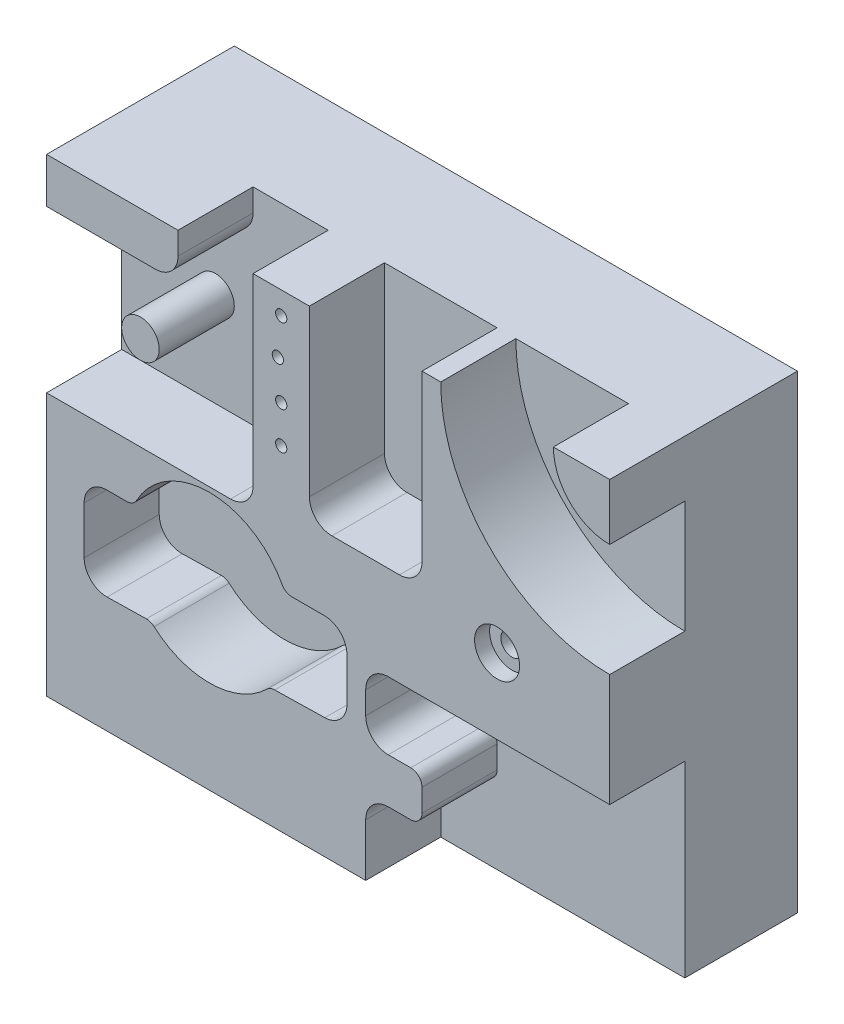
from build123d import *

# Parameters (mm, degrees)
SKETCH1_W                               = 150
SKETCH1_H                               = 125
BOSS_EXTRUDE1_DEPTH                     = 50
SKETCH2_W                               = 20
SKETCH2_H                               = 50
CUT_EXTRUDE1_DEPTH                      = 65
SKETCH3_W                               = 15
SKETCH3_H                               = 12
BOSS_EXTRUDE2_DEPTH                     = 20
SKETCH4_W                               = 55
SKETCH4_H                               = 55
CUT_EXTRUDE2_DEPTH                      = 20
SKETCH5_R                               = 5
BOSS_EXTRUDE3_DEPTH                     = 20
SKETCH6_W                               = 35
SKETCH6_H                               = 12
BOSS_EXTRUDE4_DEPTH                     = 20
CUT_EXTRUDE3_DEPTH                      = 20
BOSS_EXTRUDE5_DEPTH                     = 20
SKETCH9_W                               = 30
SKETCH9_H                               = 20
CUT_EXTRUDE4_DEPTH                      = 50
CUT_EXTRUDE5_DEPTH                      = 20
FILLET1_R                               = 3
FILLET7_R                               = 6
FILLET8_R                               = 6
CBORE_FOR_M5_HEX_HEAD_BOLT1_D           = 6
CBORE_FOR_M5_HEX_HEAD_BOLT1_DEPTH       = 19
CBORE_FOR_M5_HEX_HEAD_BOLT1_CBORE_D     = 12
CBORE_FOR_M5_HEX_HEAD_BOLT1_CBORE_DEPTH = 4
CBORE_FOR_M5_HEX_HEAD_BOLT1_TIP         = 1.802581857
F_3_0_3_DIAMETER_HOLE1_D                = 3
F_3_0_3_DIAMETER_HOLE1_DEPTH            = 12
F_3_0_3_DIAMETER_HOLE1_TIP              = 0.901290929


with BuildPart() as part:
    # Sketch1 → Boss-Extrude1 (new body)
    with BuildSketch(Plane.XY):
        Rectangle(SKETCH1_W, SKETCH1_H)
    extrude(amount=-BOSS_EXTRUDE1_DEPTH)

    # Sketch2 → Cut-Extrude1 (cut)
    with BuildSketch(Plane(origin=(75, 0, 0), x_dir=(0, 0, -1), z_dir=(1, 0, 0))):
        with Locations((10, -37.5)):
            Rectangle(SKETCH2_W, SKETCH2_H)
    extrude(amount=-CUT_EXTRUDE1_DEPTH, mode=Mode.SUBTRACT)

    # Sketch3 → Boss-Extrude2 (add)
    with BuildSketch(Plane.XY.offset(-20)):
        with Locations((17.5, -36.5)):
            Rectangle(SKETCH3_W, SKETCH3_H)
    extrude(amount=BOSS_EXTRUDE2_DEPTH)

    # Sketch4 → Cut-Extrude2 (cut)
    with BuildSketch(Plane.XY):
        with Locations((-47.5, 35)):
            Rectangle(SKETCH4_W, SKETCH4_H)
    extrude(amount=-CUT_EXTRUDE2_DEPTH, mode=Mode.SUBTRACT)

    # Sketch5 → Boss-Extrude3 (add)
    with BuildSketch(Plane.XY.offset(-20)):
        with Locations(Location((-50, 32.5, 0), (0, 0, 90))):
            Circle(SKETCH5_R)
    extrude(amount=BOSS_EXTRUDE3_DEPTH)

    # Sketch6 → Boss-Extrude4 (add)
    with BuildSketch(Plane.XY.offset(-20)):
        with Locations((-57.5, 56.5)):
            Rectangle(SKETCH6_W, SKETCH6_H)
    extrude(amount=BOSS_EXTRUDE4_DEPTH)

    # Sketch7 → Cut-Extrude3 (cut)
    with BuildSketch(Plane.XY):
        with BuildLine():
            Line((75, 62.5), (30, 62.5))
            ThreePointArc((30, 62.5), (43.180194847, 30.680194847), (75, 17.5))
            Line((75, 17.5), (75, 62.5))
        make_face()
    extrude(amount=-CUT_EXTRUDE3_DEPTH, mode=Mode.SUBTRACT)

    # Sketch8 → Boss-Extrude5 (add)
    with BuildSketch(Plane.XY.offset(-20)):
        with BuildLine():
            Line((60, 62.5), (75, 62.5))
            Line((75, 62.5), (75, 47.5))
            ThreePointArc((75, 47.5), (64.393398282, 51.893398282), (60, 62.5))
        make_face()
    extrude(amount=BOSS_EXTRUDE5_DEPTH)

    # Sketch9 → Cut-Extrude4 (cut)
    with BuildSketch(Plane(origin=(0, 62.5, 0), x_dir=(-1, 0, 0), z_dir=(0, 1, 0))):
        with Locations((-10, -10)):
            Rectangle(SKETCH9_W, SKETCH9_H)
    extrude(amount=-CUT_EXTRUDE4_DEPTH, mode=Mode.SUBTRACT)

    # Sketch10 → Cut-Extrude5 (cut)
    with BuildSketch(Plane.XY):
        with BuildLine():
            Line((-15.49376608, -30.690838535), (5, -30.278372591))
            Line((5, -30.278372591), (5, -6.902576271))
            Line((5, -6.902576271), (-11.508118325, -6.902576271))
            ThreePointArc((-11.508118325, -6.902576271), (-31.647948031, 6.243765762), (-51.787777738, -6.902576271))
            Line((-51.787777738, -6.902576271), (-65, -6.902576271))
            Line((-65, -6.902576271), (-65, -31.687221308))
            Line((-65, -31.687221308), (-47.188131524, -31.328732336))
            ThreePointArc((-47.188131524, -31.328732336), (-31.205256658, -37.751779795), (-15.49376608, -30.690838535))
        make_face()
    extrude(amount=-CUT_EXTRUDE5_DEPTH, mode=Mode.SUBTRACT)

    # Fillet1
    fillet1_edges = [part.edges().sort_by_distance(p)[0] for p in [
        (-11.508118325, -6.902576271, -10),
        (-51.787777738, -6.902576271, -10),
        (-47.188131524, -31.328732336, -10),
        (-15.49376608, -30.690838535, -10),
        (25, -42.5, -10),
        (25, -30.5, -10),
    ]]
    fillet(fillet1_edges, radius=FILLET1_R)

    # Fillet7
    fillet7_edges = [part.edges().sort_by_distance(p)[0] for p in [
        (-40, 50.5, -10),
    ]]
    fillet(fillet7_edges, radius=FILLET7_R)

    # Fillet8
    fillet8_edges = [part.edges().sort_by_distance(p)[0] for p in [
        (25, 12.5, -10),
        (-5, 12.5, -10),
        (5, -30.278372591, -10),
        (5, -6.902576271, -10),
        (-65, -6.902576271, -10),
        (-65, -31.687221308, -10),
        (10, -12.5, -10),
        (10, -30.5, -10),
        (10, -42.5, -10),
        (-20, 7.5, -10),
    ]]
    fillet(fillet8_edges, radius=FILLET8_R)

    # CBORE for M5 Hex Head Bolt1
    with Locations(Plane.XY):
        with Locations((45, 7.5)):
            CounterBoreHole(CBORE_FOR_M5_HEX_HEAD_BOLT1_D / 2, CBORE_FOR_M5_HEX_HEAD_BOLT1_CBORE_D / 2, CBORE_FOR_M5_HEX_HEAD_BOLT1_CBORE_DEPTH, depth=CBORE_FOR_M5_HEX_HEAD_BOLT1_DEPTH)
            with Locations((0, 0, -(CBORE_FOR_M5_HEX_HEAD_BOLT1_DEPTH + CBORE_FOR_M5_HEX_HEAD_BOLT1_TIP / 2))):  # 118° drill point
                Cone(0, CBORE_FOR_M5_HEX_HEAD_BOLT1_D / 2, CBORE_FOR_M5_HEX_HEAD_BOLT1_TIP, mode=Mode.SUBTRACT)

    # 3.0 _3_ Diameter Hole1
    with Locations(Plane.XY):
        with Locations((-13.401783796, 46.5), (-12.5, 56.5), (-12.5, 36.5), (-12.5, 26.5)):
            Hole(F_3_0_3_DIAMETER_HOLE1_D / 2, depth=F_3_0_3_DIAMETER_HOLE1_DEPTH)
            with Locations((0, 0, -(F_3_0_3_DIAMETER_HOLE1_DEPTH + F_3_0_3_DIAMETER_HOLE1_TIP / 2))):  # 118° drill point
                Cone(0, F_3_0_3_DIAMETER_HOLE1_D / 2, F_3_0_3_DIAMETER_HOLE1_TIP, mode=Mode.SUBTRACT)


solid = part.part
